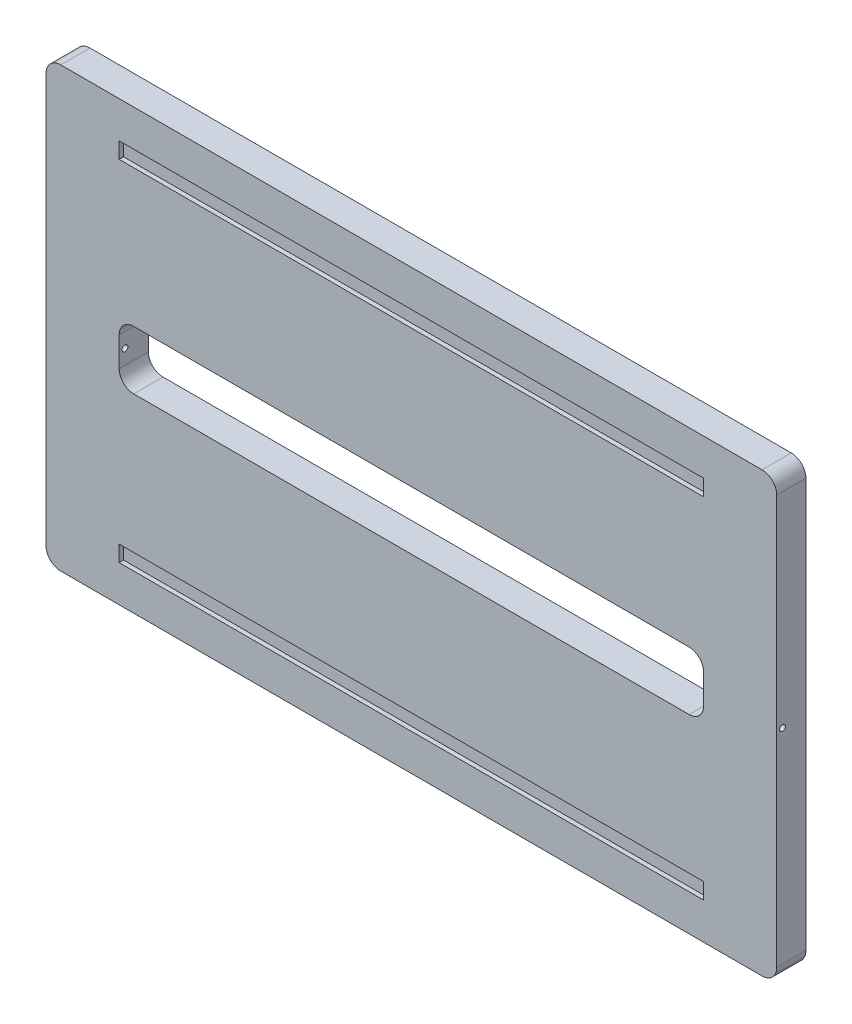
ISO-10303-21;
HEADER;
FILE_DESCRIPTION(('STEP AP214'),'2;1');
FILE_NAME('part.step','',(''),(''),'','','');
FILE_SCHEMA(('AUTOMOTIVE_DESIGN { 1 0 10303 214 1 1 1 1 }'));
ENDSEC;
DATA;
#1=APPLICATION_CONTEXT('core data for automotive mechanical design processes');
#2=APPLICATION_PROTOCOL_DEFINITION('international standard','automotive_design',2000,#1);
#3=PRODUCT_CONTEXT('',#1,'mechanical');
#4=PRODUCT('Part','Part','',(#3));
#5=PRODUCT_RELATED_PRODUCT_CATEGORY('part','',(#4));
#6=PRODUCT_DEFINITION_FORMATION('','',#4);
#7=PRODUCT_DEFINITION_CONTEXT('part definition',#1,'design');
#8=PRODUCT_DEFINITION('design','',#6,#7);
#9=PRODUCT_DEFINITION_SHAPE('','',#8);
#10=(LENGTH_UNIT() NAMED_UNIT(*) SI_UNIT(.MILLI.,.METRE.));
#11=(NAMED_UNIT(*) PLANE_ANGLE_UNIT() SI_UNIT($,.RADIAN.));
#12=(NAMED_UNIT(*) SI_UNIT($,.STERADIAN.) SOLID_ANGLE_UNIT());
#13=UNCERTAINTY_MEASURE_WITH_UNIT(LENGTH_MEASURE(1.E-05),#10,'distance_accuracy_value','');
#14=(GEOMETRIC_REPRESENTATION_CONTEXT(3) GLOBAL_UNCERTAINTY_ASSIGNED_CONTEXT((#13)) GLOBAL_UNIT_ASSIGNED_CONTEXT((#10,
#11,#12)) REPRESENTATION_CONTEXT('',''));
#15=CARTESIAN_POINT('',(0.,0.,0.));
#16=DIRECTION('',(0.,0.,1.));
#17=DIRECTION('',(1.,0.,0.));
#18=AXIS2_PLACEMENT_3D('',#15,#16,#17);
#19=CARTESIAN_POINT('',(50.,264.,17.));
#20=DIRECTION('',(0.,-1.,0.));
#21=DIRECTION('',(0.,0.,-1.));
#22=AXIS2_PLACEMENT_3D('',#19,#20,#21);
#23=PLANE('',#22);
#24=DIRECTION('',(0.,0.,-1.));
#25=VECTOR('',#24,1.);
#26=CARTESIAN_POINT('',(450.,264.,20.));
#27=LINE('',#26,#25);
#28=CARTESIAN_POINT('',(450.,264.,20.));
#29=VERTEX_POINT('',#28);
#30=CARTESIAN_POINT('',(450.,264.,17.));
#31=VERTEX_POINT('',#30);
#32=EDGE_CURVE('E217',#29,#31,#27,.T.);
#33=ORIENTED_EDGE('',*,*,#32,.T.);
#34=DIRECTION('',(1.,0.,0.));
#35=VECTOR('',#34,1.);
#36=CARTESIAN_POINT('',(50.,264.,17.));
#37=LINE('',#36,#35);
#38=CARTESIAN_POINT('',(50.,264.,17.));
#39=VERTEX_POINT('',#38);
#40=EDGE_CURVE('E202',#39,#31,#37,.T.);
#41=ORIENTED_EDGE('',*,*,#40,.F.);
#42=DIRECTION('',(0.,0.,-1.));
#43=VECTOR('',#42,1.);
#44=CARTESIAN_POINT('',(50.,264.,17.));
#45=LINE('',#44,#43);
#46=CARTESIAN_POINT('',(50.,264.,20.));
#47=VERTEX_POINT('',#46);
#48=EDGE_CURVE('E245',#47,#39,#45,.T.);
#49=ORIENTED_EDGE('',*,*,#48,.F.);
#50=DIRECTION('',(-1.,0.,0.));
#51=VECTOR('',#50,1.);
#52=CARTESIAN_POINT('',(0.,264.,20.));
#53=LINE('',#52,#51);
#54=EDGE_CURVE('E218',#29,#47,#53,.T.);
#55=ORIENTED_EDGE('',*,*,#54,.F.);
#56=EDGE_LOOP('',(#33,#41,#49,#55));
#57=FACE_BOUND('',#56,.T.);
#58=ADVANCED_FACE('F38',(#57),#23,.F.);
#59=CARTESIAN_POINT('',(50.,275.,17.));
#60=DIRECTION('',(0.,1.,0.));
#61=DIRECTION('',(0.,0.,1.));
#62=AXIS2_PLACEMENT_3D('',#59,#60,#61);
#63=PLANE('',#62);
#64=DIRECTION('',(0.,0.,-1.));
#65=VECTOR('',#64,1.);
#66=CARTESIAN_POINT('',(450.,275.,20.));
#67=LINE('',#66,#65);
#68=CARTESIAN_POINT('',(450.,275.,20.));
#69=VERTEX_POINT('',#68);
#70=CARTESIAN_POINT('',(450.,275.,17.));
#71=VERTEX_POINT('',#70);
#72=EDGE_CURVE('E223',#69,#71,#67,.T.);
#73=ORIENTED_EDGE('',*,*,#72,.F.);
#74=DIRECTION('',(1.,0.,0.));
#75=VECTOR('',#74,1.);
#76=CARTESIAN_POINT('',(0.,275.,20.));
#77=LINE('',#76,#75);
#78=CARTESIAN_POINT('',(50.,275.,20.));
#79=VERTEX_POINT('',#78);
#80=EDGE_CURVE('E329',#79,#69,#77,.T.);
#81=ORIENTED_EDGE('',*,*,#80,.F.);
#82=DIRECTION('',(0.,0.,1.));
#83=VECTOR('',#82,1.);
#84=CARTESIAN_POINT('',(50.,275.,17.));
#85=LINE('',#84,#83);
#86=CARTESIAN_POINT('',(50.,275.,17.));
#87=VERTEX_POINT('',#86);
#88=EDGE_CURVE('E242',#87,#79,#85,.T.);
#89=ORIENTED_EDGE('',*,*,#88,.F.);
#90=DIRECTION('',(1.,0.,0.));
#91=VECTOR('',#90,1.);
#92=CARTESIAN_POINT('',(50.,275.,17.));
#93=LINE('',#92,#91);
#94=EDGE_CURVE('E214',#87,#71,#93,.T.);
#95=ORIENTED_EDGE('',*,*,#94,.T.);
#96=EDGE_LOOP('',(#73,#81,#89,#95));
#97=FACE_BOUND('',#96,.T.);
#98=ADVANCED_FACE('F494',(#97),#63,.F.);
#99=CARTESIAN_POINT('',(50.,275.,17.));
#100=DIRECTION('',(0.,0.,-1.));
#101=DIRECTION('',(-1.,0.,0.));
#102=AXIS2_PLACEMENT_3D('',#99,#100,#101);
#103=PLANE('',#102);
#104=DIRECTION('',(0.,-1.,0.));
#105=VECTOR('',#104,1.);
#106=CARTESIAN_POINT('',(450.,264.,17.));
#107=LINE('',#106,#105);
#108=EDGE_CURVE('E206',#71,#31,#107,.T.);
#109=ORIENTED_EDGE('',*,*,#108,.F.);
#110=ORIENTED_EDGE('',*,*,#94,.F.);
#111=DIRECTION('',(0.,1.,0.));
#112=VECTOR('',#111,1.);
#113=CARTESIAN_POINT('',(50.,275.,17.));
#114=LINE('',#113,#112);
#115=EDGE_CURVE('E209',#39,#87,#114,.T.);
#116=ORIENTED_EDGE('',*,*,#115,.F.);
#117=ORIENTED_EDGE('',*,*,#40,.T.);
#118=EDGE_LOOP('',(#109,#110,#116,#117));
#119=FACE_BOUND('',#118,.T.);
#120=ADVANCED_FACE('F204',(#119),#103,.F.);
#121=CARTESIAN_POINT('',(50.,25.,17.));
#122=DIRECTION('',(0.,-1.,0.));
#123=DIRECTION('',(0.,0.,-1.));
#124=AXIS2_PLACEMENT_3D('',#121,#122,#123);
#125=PLANE('',#124);
#126=DIRECTION('',(0.,0.,-1.));
#127=VECTOR('',#126,1.);
#128=CARTESIAN_POINT('',(450.,25.,20.));
#129=LINE('',#128,#127);
#130=CARTESIAN_POINT('',(450.,25.,20.));
#131=VERTEX_POINT('',#130);
#132=CARTESIAN_POINT('',(450.,25.,17.));
#133=VERTEX_POINT('',#132);
#134=EDGE_CURVE('E254',#131,#133,#129,.T.);
#135=ORIENTED_EDGE('',*,*,#134,.T.);
#136=DIRECTION('',(1.,0.,0.));
#137=VECTOR('',#136,1.);
#138=CARTESIAN_POINT('',(50.,25.,17.));
#139=LINE('',#138,#137);
#140=CARTESIAN_POINT('',(50.,25.,17.));
#141=VERTEX_POINT('',#140);
#142=EDGE_CURVE('E276',#141,#133,#139,.T.);
#143=ORIENTED_EDGE('',*,*,#142,.F.);
#144=DIRECTION('',(0.,0.,-1.));
#145=VECTOR('',#144,1.);
#146=CARTESIAN_POINT('',(50.,25.,17.));
#147=LINE('',#146,#145);
#148=CARTESIAN_POINT('',(50.,25.,20.));
#149=VERTEX_POINT('',#148);
#150=EDGE_CURVE('E272',#149,#141,#147,.T.);
#151=ORIENTED_EDGE('',*,*,#150,.F.);
#152=DIRECTION('',(-1.,0.,0.));
#153=VECTOR('',#152,1.);
#154=CARTESIAN_POINT('',(0.,25.,20.));
#155=LINE('',#154,#153);
#156=EDGE_CURVE('E322',#131,#149,#155,.T.);
#157=ORIENTED_EDGE('',*,*,#156,.F.);
#158=EDGE_LOOP('',(#135,#143,#151,#157));
#159=FACE_BOUND('',#158,.T.);
#160=ADVANCED_FACE('F507',(#159),#125,.F.);
#161=CARTESIAN_POINT('',(50.,36.,17.));
#162=DIRECTION('',(0.,1.,0.));
#163=DIRECTION('',(0.,0.,1.));
#164=AXIS2_PLACEMENT_3D('',#161,#162,#163);
#165=PLANE('',#164);
#166=DIRECTION('',(0.,0.,-1.));
#167=VECTOR('',#166,1.);
#168=CARTESIAN_POINT('',(450.,36.,20.));
#169=LINE('',#168,#167);
#170=CARTESIAN_POINT('',(450.,36.,20.));
#171=VERTEX_POINT('',#170);
#172=CARTESIAN_POINT('',(450.,36.,17.));
#173=VERTEX_POINT('',#172);
#174=EDGE_CURVE('E261',#171,#173,#169,.T.);
#175=ORIENTED_EDGE('',*,*,#174,.F.);
#176=DIRECTION('',(1.,0.,0.));
#177=VECTOR('',#176,1.);
#178=CARTESIAN_POINT('',(0.,36.,20.));
#179=LINE('',#178,#177);
#180=CARTESIAN_POINT('',(50.,36.,20.));
#181=VERTEX_POINT('',#180);
#182=EDGE_CURVE('E318',#181,#171,#179,.T.);
#183=ORIENTED_EDGE('',*,*,#182,.F.);
#184=DIRECTION('',(0.,0.,1.));
#185=VECTOR('',#184,1.);
#186=CARTESIAN_POINT('',(50.,36.,17.));
#187=LINE('',#186,#185);
#188=CARTESIAN_POINT('',(50.,36.,17.));
#189=VERTEX_POINT('',#188);
#190=EDGE_CURVE('E269',#189,#181,#187,.T.);
#191=ORIENTED_EDGE('',*,*,#190,.F.);
#192=DIRECTION('',(1.,0.,0.));
#193=VECTOR('',#192,1.);
#194=CARTESIAN_POINT('',(50.,36.,17.));
#195=LINE('',#194,#193);
#196=EDGE_CURVE('E275',#189,#173,#195,.T.);
#197=ORIENTED_EDGE('',*,*,#196,.T.);
#198=EDGE_LOOP('',(#175,#183,#191,#197));
#199=FACE_BOUND('',#198,.T.);
#200=ADVANCED_FACE('F518',(#199),#165,.F.);
#201=CARTESIAN_POINT('',(50.,25.,17.));
#202=DIRECTION('',(0.,0.,-1.));
#203=DIRECTION('',(-1.,0.,0.));
#204=AXIS2_PLACEMENT_3D('',#201,#202,#203);
#205=PLANE('',#204);
#206=DIRECTION('',(0.,-1.,0.));
#207=VECTOR('',#206,1.);
#208=CARTESIAN_POINT('',(450.,36.,17.));
#209=LINE('',#208,#207);
#210=EDGE_CURVE('E213',#173,#133,#209,.T.);
#211=ORIENTED_EDGE('',*,*,#210,.F.);
#212=ORIENTED_EDGE('',*,*,#196,.F.);
#213=DIRECTION('',(0.,1.,0.));
#214=VECTOR('',#213,1.);
#215=CARTESIAN_POINT('',(50.,25.,17.));
#216=LINE('',#215,#214);
#217=EDGE_CURVE('E265',#141,#189,#216,.T.);
#218=ORIENTED_EDGE('',*,*,#217,.F.);
#219=ORIENTED_EDGE('',*,*,#142,.T.);
#220=EDGE_LOOP('',(#211,#212,#218,#219));
#221=FACE_BOUND('',#220,.T.);
#222=ADVANCED_FACE('F522',(#221),#205,.F.);
#223=CARTESIAN_POINT('',(0.,0.,20.));
#224=DIRECTION('',(1.,0.,0.));
#225=DIRECTION('',(0.,0.,-1.));
#226=AXIS2_PLACEMENT_3D('',#223,#224,#225);
#227=PLANE('',#226);
#228=CARTESIAN_POINT('',(0.,150.,16.));
#229=DIRECTION('',(1.,0.,0.));
#230=DIRECTION('',(0.,0.,-1.));
#231=AXIS2_PLACEMENT_3D('',#228,#229,#230);
#232=CIRCLE('',#231,2.);
#233=CARTESIAN_POINT('',(0.,150.,14.));
#234=VERTEX_POINT('',#233);
#235=EDGE_CURVE('E810',#234,#234,#232,.T.);
#236=ORIENTED_EDGE('',*,*,#235,.T.);
#237=EDGE_LOOP('',(#236));
#238=FACE_BOUND('',#237,.T.);
#239=DIRECTION('',(0.,-1.,0.));
#240=VECTOR('',#239,1.);
#241=CARTESIAN_POINT('',(0.,0.,20.));
#242=LINE('',#241,#240);
#243=CARTESIAN_POINT('',(0.,290.,20.));
#244=VERTEX_POINT('',#243);
#245=CARTESIAN_POINT('',(0.,10.,20.));
#246=VERTEX_POINT('',#245);
#247=EDGE_CURVE('E283',#244,#246,#242,.T.);
#248=ORIENTED_EDGE('',*,*,#247,.F.);
#249=DIRECTION('',(0.,0.,-1.));
#250=VECTOR('',#249,1.);
#251=CARTESIAN_POINT('',(0.,290.,20.));
#252=LINE('',#251,#250);
#253=CARTESIAN_POINT('',(0.,290.,0.));
#254=VERTEX_POINT('',#253);
#255=EDGE_CURVE('E338',#244,#254,#252,.T.);
#256=ORIENTED_EDGE('',*,*,#255,.T.);
#257=DIRECTION('',(0.,-1.,0.));
#258=VECTOR('',#257,1.);
#259=CARTESIAN_POINT('',(0.,0.,0.));
#260=LINE('',#259,#258);
#261=CARTESIAN_POINT('',(0.,10.,0.));
#262=VERTEX_POINT('',#261);
#263=EDGE_CURVE('E279',#254,#262,#260,.T.);
#264=ORIENTED_EDGE('',*,*,#263,.T.);
#265=DIRECTION('',(0.,0.,-1.));
#266=VECTOR('',#265,1.);
#267=CARTESIAN_POINT('',(0.,10.,20.));
#268=LINE('',#267,#266);
#269=EDGE_CURVE('E335',#262,#246,#268,.F.);
#270=ORIENTED_EDGE('',*,*,#269,.T.);
#271=EDGE_LOOP('',(#248,#256,#264,#270));
#272=FACE_BOUND('',#271,.T.);
#273=ADVANCED_FACE('F526',(#238,#272),#227,.F.);
#274=CARTESIAN_POINT('',(0.,0.,20.));
#275=DIRECTION('',(0.,1.,0.));
#276=DIRECTION('',(0.,0.,1.));
#277=AXIS2_PLACEMENT_3D('',#274,#275,#276);
#278=PLANE('',#277);
#279=DIRECTION('',(1.,0.,0.));
#280=VECTOR('',#279,1.);
#281=CARTESIAN_POINT('',(0.,0.,20.));
#282=LINE('',#281,#280);
#283=CARTESIAN_POINT('',(10.,0.,20.));
#284=VERTEX_POINT('',#283);
#285=CARTESIAN_POINT('',(490.,0.,20.));
#286=VERTEX_POINT('',#285);
#287=EDGE_CURVE('E287',#284,#286,#282,.T.);
#288=ORIENTED_EDGE('',*,*,#287,.F.);
#289=DIRECTION('',(0.,0.,-1.));
#290=VECTOR('',#289,1.);
#291=CARTESIAN_POINT('',(10.,0.,20.));
#292=LINE('',#291,#290);
#293=CARTESIAN_POINT('',(10.,0.,0.));
#294=VERTEX_POINT('',#293);
#295=EDGE_CURVE('E383',#284,#294,#292,.T.);
#296=ORIENTED_EDGE('',*,*,#295,.T.);
#297=DIRECTION('',(1.,0.,0.));
#298=VECTOR('',#297,1.);
#299=CARTESIAN_POINT('',(0.,0.,0.));
#300=LINE('',#299,#298);
#301=CARTESIAN_POINT('',(490.,0.,0.));
#302=VERTEX_POINT('',#301);
#303=EDGE_CURVE('E304',#294,#302,#300,.T.);
#304=ORIENTED_EDGE('',*,*,#303,.T.);
#305=DIRECTION('',(0.,0.,-1.));
#306=VECTOR('',#305,1.);
#307=CARTESIAN_POINT('',(490.,0.,20.));
#308=LINE('',#307,#306);
#309=EDGE_CURVE('E380',#302,#286,#308,.F.);
#310=ORIENTED_EDGE('',*,*,#309,.T.);
#311=EDGE_LOOP('',(#288,#296,#304,#310));
#312=FACE_BOUND('',#311,.T.);
#313=ADVANCED_FACE('F539',(#312),#278,.F.);
#314=CARTESIAN_POINT('',(500.,0.,20.));
#315=DIRECTION('',(-1.,0.,0.));
#316=DIRECTION('',(0.,0.,1.));
#317=AXIS2_PLACEMENT_3D('',#314,#315,#316);
#318=PLANE('',#317);
#319=CARTESIAN_POINT('',(500.,150.,16.));
#320=DIRECTION('',(1.,0.,0.));
#321=DIRECTION('',(0.,0.,-1.));
#322=AXIS2_PLACEMENT_3D('',#319,#320,#321);
#323=CIRCLE('',#322,2.);
#324=CARTESIAN_POINT('',(500.,150.,14.));
#325=VERTEX_POINT('',#324);
#326=EDGE_CURVE('E816',#325,#325,#323,.T.);
#327=ORIENTED_EDGE('',*,*,#326,.F.);
#328=EDGE_LOOP('',(#327));
#329=FACE_BOUND('',#328,.T.);
#330=DIRECTION('',(0.,1.,0.));
#331=VECTOR('',#330,1.);
#332=CARTESIAN_POINT('',(500.,0.,0.));
#333=LINE('',#332,#331);
#334=CARTESIAN_POINT('',(500.,10.,0.));
#335=VERTEX_POINT('',#334);
#336=CARTESIAN_POINT('',(500.,290.,0.));
#337=VERTEX_POINT('',#336);
#338=EDGE_CURVE('E308',#335,#337,#333,.T.);
#339=ORIENTED_EDGE('',*,*,#338,.T.);
#340=DIRECTION('',(0.,0.,-1.));
#341=VECTOR('',#340,1.);
#342=CARTESIAN_POINT('',(500.,290.,20.));
#343=LINE('',#342,#341);
#344=CARTESIAN_POINT('',(500.,290.,20.));
#345=VERTEX_POINT('',#344);
#346=EDGE_CURVE('E377',#337,#345,#343,.F.);
#347=ORIENTED_EDGE('',*,*,#346,.T.);
#348=DIRECTION('',(0.,1.,0.));
#349=VECTOR('',#348,1.);
#350=CARTESIAN_POINT('',(500.,0.,20.));
#351=LINE('',#350,#349);
#352=CARTESIAN_POINT('',(500.,10.,20.));
#353=VERTEX_POINT('',#352);
#354=EDGE_CURVE('E292',#353,#345,#351,.T.);
#355=ORIENTED_EDGE('',*,*,#354,.F.);
#356=DIRECTION('',(0.,0.,-1.));
#357=VECTOR('',#356,1.);
#358=CARTESIAN_POINT('',(500.,10.,20.));
#359=LINE('',#358,#357);
#360=EDGE_CURVE('E373',#353,#335,#359,.T.);
#361=ORIENTED_EDGE('',*,*,#360,.T.);
#362=EDGE_LOOP('',(#339,#347,#355,#361));
#363=FACE_BOUND('',#362,.T.);
#364=ADVANCED_FACE('F535',(#329,#363),#318,.F.);
#365=CARTESIAN_POINT('',(0.,300.,20.));
#366=DIRECTION('',(0.,-1.,0.));
#367=DIRECTION('',(0.,0.,-1.));
#368=AXIS2_PLACEMENT_3D('',#365,#366,#367);
#369=PLANE('',#368);
#370=DIRECTION('',(-1.,0.,0.));
#371=VECTOR('',#370,1.);
#372=CARTESIAN_POINT('',(0.,300.,0.));
#373=LINE('',#372,#371);
#374=CARTESIAN_POINT('',(490.,300.,0.));
#375=VERTEX_POINT('',#374);
#376=CARTESIAN_POINT('',(10.,300.,0.));
#377=VERTEX_POINT('',#376);
#378=EDGE_CURVE('E288',#375,#377,#373,.T.);
#379=ORIENTED_EDGE('',*,*,#378,.T.);
#380=DIRECTION('',(0.,0.,-1.));
#381=VECTOR('',#380,1.);
#382=CARTESIAN_POINT('',(10.,300.,20.));
#383=LINE('',#382,#381);
#384=CARTESIAN_POINT('',(10.,300.,20.));
#385=VERTEX_POINT('',#384);
#386=EDGE_CURVE('E358',#377,#385,#383,.F.);
#387=ORIENTED_EDGE('',*,*,#386,.T.);
#388=DIRECTION('',(-1.,0.,0.));
#389=VECTOR('',#388,1.);
#390=CARTESIAN_POINT('',(0.,300.,20.));
#391=LINE('',#390,#389);
#392=CARTESIAN_POINT('',(490.,300.,20.));
#393=VERTEX_POINT('',#392);
#394=EDGE_CURVE('E296',#393,#385,#391,.T.);
#395=ORIENTED_EDGE('',*,*,#394,.F.);
#396=DIRECTION('',(0.,0.,-1.));
#397=VECTOR('',#396,1.);
#398=CARTESIAN_POINT('',(490.,300.,20.));
#399=LINE('',#398,#397);
#400=EDGE_CURVE('E354',#393,#375,#399,.T.);
#401=ORIENTED_EDGE('',*,*,#400,.T.);
#402=EDGE_LOOP('',(#379,#387,#395,#401));
#403=FACE_BOUND('',#402,.T.);
#404=ADVANCED_FACE('F530',(#403),#369,.F.);
#405=CARTESIAN_POINT('',(0.,0.,20.));
#406=DIRECTION('',(0.,0.,-1.));
#407=DIRECTION('',(-1.,0.,0.));
#408=AXIS2_PLACEMENT_3D('',#405,#406,#407);
#409=PLANE('',#408);
#410=DIRECTION('',(1.,0.,0.));
#411=VECTOR('',#410,1.);
#412=CARTESIAN_POINT('',(50.,130.,20.));
#413=LINE('',#412,#411);
#414=CARTESIAN_POINT('',(60.,130.,20.));
#415=VERTEX_POINT('',#414);
#416=CARTESIAN_POINT('',(440.,130.,20.));
#417=VERTEX_POINT('',#416);
#418=EDGE_CURVE('E439',#415,#417,#413,.T.);
#419=ORIENTED_EDGE('',*,*,#418,.F.);
#420=CARTESIAN_POINT('',(60.,140.,20.));
#421=DIRECTION('',(0.,0.,-1.));
#422=DIRECTION('',(-1.,0.,0.));
#423=AXIS2_PLACEMENT_3D('',#420,#421,#422);
#424=CIRCLE('',#423,10.);
#425=CARTESIAN_POINT('',(50.,140.,20.));
#426=VERTEX_POINT('',#425);
#427=EDGE_CURVE('E48',#415,#426,#424,.T.);
#428=ORIENTED_EDGE('',*,*,#427,.T.);
#429=DIRECTION('',(0.,-1.,0.));
#430=VECTOR('',#429,1.);
#431=CARTESIAN_POINT('',(50.,130.,20.));
#432=LINE('',#431,#430);
#433=CARTESIAN_POINT('',(50.,160.,20.));
#434=VERTEX_POINT('',#433);
#435=EDGE_CURVE('E437',#434,#426,#432,.T.);
#436=ORIENTED_EDGE('',*,*,#435,.F.);
#437=CARTESIAN_POINT('',(60.,160.,20.));
#438=DIRECTION('',(0.,0.,-1.));
#439=DIRECTION('',(-1.,0.,0.));
#440=AXIS2_PLACEMENT_3D('',#437,#438,#439);
#441=CIRCLE('',#440,10.);
#442=CARTESIAN_POINT('',(60.,170.,20.));
#443=VERTEX_POINT('',#442);
#444=EDGE_CURVE('E426',#434,#443,#441,.T.);
#445=ORIENTED_EDGE('',*,*,#444,.T.);
#446=DIRECTION('',(-1.,0.,0.));
#447=VECTOR('',#446,1.);
#448=CARTESIAN_POINT('',(50.,170.,20.));
#449=LINE('',#448,#447);
#450=CARTESIAN_POINT('',(440.,170.,20.));
#451=VERTEX_POINT('',#450);
#452=EDGE_CURVE('E464',#451,#443,#449,.T.);
#453=ORIENTED_EDGE('',*,*,#452,.F.);
#454=CARTESIAN_POINT('',(440.,160.,20.));
#455=DIRECTION('',(0.,0.,-1.));
#456=DIRECTION('',(-1.,0.,0.));
#457=AXIS2_PLACEMENT_3D('',#454,#455,#456);
#458=CIRCLE('',#457,10.);
#459=CARTESIAN_POINT('',(450.,160.,20.));
#460=VERTEX_POINT('',#459);
#461=EDGE_CURVE('E414',#451,#460,#458,.T.);
#462=ORIENTED_EDGE('',*,*,#461,.T.);
#463=DIRECTION('',(0.,1.,0.));
#464=VECTOR('',#463,1.);
#465=CARTESIAN_POINT('',(450.,130.,20.));
#466=LINE('',#465,#464);
#467=CARTESIAN_POINT('',(450.,140.,20.));
#468=VERTEX_POINT('',#467);
#469=EDGE_CURVE('E470',#468,#460,#466,.T.);
#470=ORIENTED_EDGE('',*,*,#469,.F.);
#471=CARTESIAN_POINT('',(440.,140.,20.));
#472=DIRECTION('',(0.,0.,-1.));
#473=DIRECTION('',(-1.,0.,0.));
#474=AXIS2_PLACEMENT_3D('',#471,#472,#473);
#475=CIRCLE('',#474,10.);
#476=EDGE_CURVE('E420',#468,#417,#475,.T.);
#477=ORIENTED_EDGE('',*,*,#476,.T.);
#478=EDGE_LOOP('',(#419,#428,#436,#445,#453,#462,#470,#477));
#479=FACE_BOUND('',#478,.T.);
#480=DIRECTION('',(0.,-1.,0.));
#481=VECTOR('',#480,1.);
#482=CARTESIAN_POINT('',(450.,264.,20.));
#483=LINE('',#482,#481);
#484=EDGE_CURVE('E224',#69,#29,#483,.T.);
#485=ORIENTED_EDGE('',*,*,#484,.T.);
#486=ORIENTED_EDGE('',*,*,#54,.T.);
#487=DIRECTION('',(0.,1.,0.));
#488=VECTOR('',#487,1.);
#489=CARTESIAN_POINT('',(50.,0.,20.));
#490=LINE('',#489,#488);
#491=EDGE_CURVE('E325',#47,#79,#490,.T.);
#492=ORIENTED_EDGE('',*,*,#491,.T.);
#493=ORIENTED_EDGE('',*,*,#80,.T.);
#494=EDGE_LOOP('',(#485,#486,#492,#493));
#495=FACE_BOUND('',#494,.T.);
#496=ORIENTED_EDGE('',*,*,#394,.T.);
#497=CARTESIAN_POINT('',(10.,290.,20.));
#498=DIRECTION('',(0.,0.,-1.));
#499=DIRECTION('',(-1.,0.,0.));
#500=AXIS2_PLACEMENT_3D('',#497,#498,#499);
#501=CIRCLE('',#500,10.);
#502=EDGE_CURVE('E370',#385,#244,#501,.F.);
#503=ORIENTED_EDGE('',*,*,#502,.T.);
#504=ORIENTED_EDGE('',*,*,#247,.T.);
#505=CARTESIAN_POINT('',(10.,10.,20.));
#506=DIRECTION('',(0.,0.,-1.));
#507=DIRECTION('',(-1.,0.,0.));
#508=AXIS2_PLACEMENT_3D('',#505,#506,#507);
#509=CIRCLE('',#508,10.);
#510=EDGE_CURVE('E364',#246,#284,#509,.F.);
#511=ORIENTED_EDGE('',*,*,#510,.T.);
#512=ORIENTED_EDGE('',*,*,#287,.T.);
#513=CARTESIAN_POINT('',(490.,10.,20.));
#514=DIRECTION('',(0.,0.,-1.));
#515=DIRECTION('',(-1.,0.,0.));
#516=AXIS2_PLACEMENT_3D('',#513,#514,#515);
#517=CIRCLE('',#516,10.);
#518=EDGE_CURVE('E361',#286,#353,#517,.F.);
#519=ORIENTED_EDGE('',*,*,#518,.T.);
#520=ORIENTED_EDGE('',*,*,#354,.T.);
#521=CARTESIAN_POINT('',(490.,290.,20.));
#522=DIRECTION('',(0.,0.,-1.));
#523=DIRECTION('',(-1.,0.,0.));
#524=AXIS2_PLACEMENT_3D('',#521,#522,#523);
#525=CIRCLE('',#524,10.);
#526=EDGE_CURVE('E367',#345,#393,#525,.F.);
#527=ORIENTED_EDGE('',*,*,#526,.T.);
#528=EDGE_LOOP('',(#496,#503,#504,#511,#512,#519,#520,#527));
#529=FACE_BOUND('',#528,.T.);
#530=DIRECTION('',(0.,-1.,0.));
#531=VECTOR('',#530,1.);
#532=CARTESIAN_POINT('',(450.,36.,20.));
#533=LINE('',#532,#531);
#534=EDGE_CURVE('E250',#171,#131,#533,.T.);
#535=ORIENTED_EDGE('',*,*,#534,.T.);
#536=ORIENTED_EDGE('',*,*,#156,.T.);
#537=DIRECTION('',(0.,-1.,0.));
#538=VECTOR('',#537,1.);
#539=CARTESIAN_POINT('',(50.,0.,20.));
#540=LINE('',#539,#538);
#541=EDGE_CURVE('E300',#181,#149,#540,.T.);
#542=ORIENTED_EDGE('',*,*,#541,.F.);
#543=ORIENTED_EDGE('',*,*,#182,.T.);
#544=EDGE_LOOP('',(#535,#536,#542,#543));
#545=FACE_BOUND('',#544,.T.);
#546=ADVANCED_FACE('F435',(#479,#495,#529,#545),#409,.F.);
#547=CARTESIAN_POINT('',(0.,0.,0.));
#548=DIRECTION('',(0.,0.,-1.));
#549=DIRECTION('',(-1.,0.,0.));
#550=AXIS2_PLACEMENT_3D('',#547,#548,#549);
#551=PLANE('',#550);
#552=DIRECTION('',(-1.,0.,0.));
#553=VECTOR('',#552,1.);
#554=CARTESIAN_POINT('',(50.,170.,0.));
#555=LINE('',#554,#553);
#556=CARTESIAN_POINT('',(440.,170.,0.));
#557=VERTEX_POINT('',#556);
#558=CARTESIAN_POINT('',(60.,170.,0.));
#559=VERTEX_POINT('',#558);
#560=EDGE_CURVE('E229',#557,#559,#555,.T.);
#561=ORIENTED_EDGE('',*,*,#560,.T.);
#562=CARTESIAN_POINT('',(60.,160.,0.));
#563=DIRECTION('',(0.,0.,-1.));
#564=DIRECTION('',(-1.,0.,0.));
#565=AXIS2_PLACEMENT_3D('',#562,#563,#564);
#566=CIRCLE('',#565,10.);
#567=CARTESIAN_POINT('',(50.,160.,0.));
#568=VERTEX_POINT('',#567);
#569=EDGE_CURVE('E62',#559,#568,#566,.F.);
#570=ORIENTED_EDGE('',*,*,#569,.T.);
#571=DIRECTION('',(0.,-1.,0.));
#572=VECTOR('',#571,1.);
#573=CARTESIAN_POINT('',(50.,130.,0.));
#574=LINE('',#573,#572);
#575=CARTESIAN_POINT('',(50.,140.,0.));
#576=VERTEX_POINT('',#575);
#577=EDGE_CURVE('E454',#568,#576,#574,.T.);
#578=ORIENTED_EDGE('',*,*,#577,.T.);
#579=CARTESIAN_POINT('',(60.,140.,0.));
#580=DIRECTION('',(0.,0.,-1.));
#581=DIRECTION('',(-1.,0.,0.));
#582=AXIS2_PLACEMENT_3D('',#579,#580,#581);
#583=CIRCLE('',#582,10.);
#584=CARTESIAN_POINT('',(60.,130.,0.));
#585=VERTEX_POINT('',#584);
#586=EDGE_CURVE('E11',#576,#585,#583,.F.);
#587=ORIENTED_EDGE('',*,*,#586,.T.);
#588=DIRECTION('',(1.,0.,0.));
#589=VECTOR('',#588,1.);
#590=CARTESIAN_POINT('',(50.,130.,0.));
#591=LINE('',#590,#589);
#592=CARTESIAN_POINT('',(440.,130.,0.));
#593=VERTEX_POINT('',#592);
#594=EDGE_CURVE('E452',#585,#593,#591,.T.);
#595=ORIENTED_EDGE('',*,*,#594,.T.);
#596=CARTESIAN_POINT('',(440.,140.,0.));
#597=DIRECTION('',(0.,0.,-1.));
#598=DIRECTION('',(-1.,0.,0.));
#599=AXIS2_PLACEMENT_3D('',#596,#597,#598);
#600=CIRCLE('',#599,10.);
#601=CARTESIAN_POINT('',(450.,140.,0.));
#602=VERTEX_POINT('',#601);
#603=EDGE_CURVE('E423',#593,#602,#600,.F.);
#604=ORIENTED_EDGE('',*,*,#603,.T.);
#605=DIRECTION('',(0.,1.,0.));
#606=VECTOR('',#605,1.);
#607=CARTESIAN_POINT('',(450.,130.,0.));
#608=LINE('',#607,#606);
#609=CARTESIAN_POINT('',(450.,160.,0.));
#610=VERTEX_POINT('',#609);
#611=EDGE_CURVE('E234',#602,#610,#608,.T.);
#612=ORIENTED_EDGE('',*,*,#611,.T.);
#613=CARTESIAN_POINT('',(440.,160.,0.));
#614=DIRECTION('',(0.,0.,-1.));
#615=DIRECTION('',(-1.,0.,0.));
#616=AXIS2_PLACEMENT_3D('',#613,#614,#615);
#617=CIRCLE('',#616,10.);
#618=EDGE_CURVE('E417',#610,#557,#617,.F.);
#619=ORIENTED_EDGE('',*,*,#618,.T.);
#620=EDGE_LOOP('',(#561,#570,#578,#587,#595,#604,#612,#619));
#621=FACE_BOUND('',#620,.T.);
#622=ORIENTED_EDGE('',*,*,#263,.F.);
#623=CARTESIAN_POINT('',(10.,290.,0.));
#624=DIRECTION('',(0.,0.,-1.));
#625=DIRECTION('',(-1.,0.,0.));
#626=AXIS2_PLACEMENT_3D('',#623,#624,#625);
#627=CIRCLE('',#626,10.);
#628=EDGE_CURVE('E351',#254,#377,#627,.T.);
#629=ORIENTED_EDGE('',*,*,#628,.T.);
#630=ORIENTED_EDGE('',*,*,#378,.F.);
#631=CARTESIAN_POINT('',(490.,290.,0.));
#632=DIRECTION('',(0.,0.,-1.));
#633=DIRECTION('',(-1.,0.,0.));
#634=AXIS2_PLACEMENT_3D('',#631,#632,#633);
#635=CIRCLE('',#634,10.);
#636=EDGE_CURVE('E348',#375,#337,#635,.T.);
#637=ORIENTED_EDGE('',*,*,#636,.T.);
#638=ORIENTED_EDGE('',*,*,#338,.F.);
#639=CARTESIAN_POINT('',(490.,10.,0.));
#640=DIRECTION('',(0.,0.,-1.));
#641=DIRECTION('',(-1.,0.,0.));
#642=AXIS2_PLACEMENT_3D('',#639,#640,#641);
#643=CIRCLE('',#642,10.);
#644=EDGE_CURVE('E342',#335,#302,#643,.T.);
#645=ORIENTED_EDGE('',*,*,#644,.T.);
#646=ORIENTED_EDGE('',*,*,#303,.F.);
#647=CARTESIAN_POINT('',(10.,10.,0.));
#648=DIRECTION('',(0.,0.,-1.));
#649=DIRECTION('',(-1.,0.,0.));
#650=AXIS2_PLACEMENT_3D('',#647,#648,#649);
#651=CIRCLE('',#650,10.);
#652=EDGE_CURVE('E345',#294,#262,#651,.T.);
#653=ORIENTED_EDGE('',*,*,#652,.T.);
#654=EDGE_LOOP('',(#622,#629,#630,#637,#638,#645,#646,#653));
#655=FACE_BOUND('',#654,.T.);
#656=ADVANCED_FACE('F450',(#621,#655),#551,.T.);
#657=CARTESIAN_POINT('',(50.,0.,0.));
#658=DIRECTION('',(1.,0.,0.));
#659=DIRECTION('',(0.,0.,-1.));
#660=AXIS2_PLACEMENT_3D('',#657,#658,#659);
#661=PLANE('',#660);
#662=ORIENTED_EDGE('',*,*,#541,.T.);
#663=ORIENTED_EDGE('',*,*,#150,.T.);
#664=ORIENTED_EDGE('',*,*,#217,.T.);
#665=ORIENTED_EDGE('',*,*,#190,.T.);
#666=EDGE_LOOP('',(#662,#663,#664,#665));
#667=FACE_BOUND('',#666,.T.);
#668=ADVANCED_FACE('F511',(#667),#661,.T.);
#669=CARTESIAN_POINT('',(450.,36.,20.));
#670=DIRECTION('',(1.,0.,0.));
#671=DIRECTION('',(0.,0.,-1.));
#672=AXIS2_PLACEMENT_3D('',#669,#670,#671);
#673=PLANE('',#672);
#674=ORIENTED_EDGE('',*,*,#210,.T.);
#675=ORIENTED_EDGE('',*,*,#134,.F.);
#676=ORIENTED_EDGE('',*,*,#534,.F.);
#677=ORIENTED_EDGE('',*,*,#174,.T.);
#678=EDGE_LOOP('',(#674,#675,#676,#677));
#679=FACE_BOUND('',#678,.T.);
#680=ADVANCED_FACE('F508',(#679),#673,.F.);
#681=CARTESIAN_POINT('',(50.,0.,0.));
#682=DIRECTION('',(-1.,0.,0.));
#683=DIRECTION('',(0.,0.,1.));
#684=AXIS2_PLACEMENT_3D('',#681,#682,#683);
#685=PLANE('',#684);
#686=ORIENTED_EDGE('',*,*,#48,.T.);
#687=ORIENTED_EDGE('',*,*,#115,.T.);
#688=ORIENTED_EDGE('',*,*,#88,.T.);
#689=ORIENTED_EDGE('',*,*,#491,.F.);
#690=EDGE_LOOP('',(#686,#687,#688,#689));
#691=FACE_BOUND('',#690,.T.);
#692=ADVANCED_FACE('F502',(#691),#685,.F.);
#693=CARTESIAN_POINT('',(450.,264.,20.));
#694=DIRECTION('',(1.,0.,0.));
#695=DIRECTION('',(0.,1.,0.));
#696=AXIS2_PLACEMENT_3D('',#693,#694,#695);
#697=PLANE('',#696);
#698=ORIENTED_EDGE('',*,*,#108,.T.);
#699=ORIENTED_EDGE('',*,*,#32,.F.);
#700=ORIENTED_EDGE('',*,*,#484,.F.);
#701=ORIENTED_EDGE('',*,*,#72,.T.);
#702=EDGE_LOOP('',(#698,#699,#700,#701));
#703=FACE_BOUND('',#702,.T.);
#704=ADVANCED_FACE('F227',(#703),#697,.F.);
#705=CARTESIAN_POINT('',(10.,290.,20.));
#706=DIRECTION('',(0.,0.,-1.));
#707=DIRECTION('',(-1.,0.,0.));
#708=AXIS2_PLACEMENT_3D('',#705,#706,#707);
#709=CYLINDRICAL_SURFACE('',#708,10.);
#710=ORIENTED_EDGE('',*,*,#502,.F.);
#711=ORIENTED_EDGE('',*,*,#386,.F.);
#712=ORIENTED_EDGE('',*,*,#628,.F.);
#713=ORIENTED_EDGE('',*,*,#255,.F.);
#714=EDGE_LOOP('',(#710,#711,#712,#713));
#715=FACE_BOUND('',#714,.T.);
#716=ADVANCED_FACE('F547',(#715),#709,.T.);
#717=CARTESIAN_POINT('',(490.,290.,20.));
#718=DIRECTION('',(0.,0.,-1.));
#719=DIRECTION('',(-1.,0.,0.));
#720=AXIS2_PLACEMENT_3D('',#717,#718,#719);
#721=CYLINDRICAL_SURFACE('',#720,10.);
#722=ORIENTED_EDGE('',*,*,#526,.F.);
#723=ORIENTED_EDGE('',*,*,#346,.F.);
#724=ORIENTED_EDGE('',*,*,#636,.F.);
#725=ORIENTED_EDGE('',*,*,#400,.F.);
#726=EDGE_LOOP('',(#722,#723,#724,#725));
#727=FACE_BOUND('',#726,.T.);
#728=ADVANCED_FACE('F550',(#727),#721,.T.);
#729=CARTESIAN_POINT('',(10.,10.,20.));
#730=DIRECTION('',(0.,0.,-1.));
#731=DIRECTION('',(-1.,0.,0.));
#732=AXIS2_PLACEMENT_3D('',#729,#730,#731);
#733=CYLINDRICAL_SURFACE('',#732,10.);
#734=ORIENTED_EDGE('',*,*,#510,.F.);
#735=ORIENTED_EDGE('',*,*,#269,.F.);
#736=ORIENTED_EDGE('',*,*,#652,.F.);
#737=ORIENTED_EDGE('',*,*,#295,.F.);
#738=EDGE_LOOP('',(#734,#735,#736,#737));
#739=FACE_BOUND('',#738,.T.);
#740=ADVANCED_FACE('F554',(#739),#733,.T.);
#741=CARTESIAN_POINT('',(490.,10.,20.));
#742=DIRECTION('',(0.,0.,-1.));
#743=DIRECTION('',(-1.,0.,0.));
#744=AXIS2_PLACEMENT_3D('',#741,#742,#743);
#745=CYLINDRICAL_SURFACE('',#744,10.);
#746=ORIENTED_EDGE('',*,*,#518,.F.);
#747=ORIENTED_EDGE('',*,*,#309,.F.);
#748=ORIENTED_EDGE('',*,*,#644,.F.);
#749=ORIENTED_EDGE('',*,*,#360,.F.);
#750=EDGE_LOOP('',(#746,#747,#748,#749));
#751=FACE_BOUND('',#750,.T.);
#752=ADVANCED_FACE('F558',(#751),#745,.T.);
#753=CARTESIAN_POINT('',(50.,130.,0.));
#754=DIRECTION('',(-1.,0.,0.));
#755=DIRECTION('',(0.,0.,1.));
#756=AXIS2_PLACEMENT_3D('',#753,#754,#755);
#757=PLANE('',#756);
#758=CARTESIAN_POINT('',(50.,150.,16.));
#759=DIRECTION('',(-1.,0.,0.));
#760=DIRECTION('',(0.,0.,1.));
#761=AXIS2_PLACEMENT_3D('',#758,#759,#760);
#762=CIRCLE('',#761,2.);
#763=CARTESIAN_POINT('',(50.,150.,18.));
#764=VERTEX_POINT('',#763);
#765=EDGE_CURVE('E445',#764,#764,#762,.T.);
#766=ORIENTED_EDGE('',*,*,#765,.T.);
#767=EDGE_LOOP('',(#766));
#768=FACE_BOUND('',#767,.T.);
#769=ORIENTED_EDGE('',*,*,#577,.F.);
#770=DIRECTION('',(0.,0.,1.));
#771=VECTOR('',#770,1.);
#772=CARTESIAN_POINT('',(50.,160.,20.));
#773=LINE('',#772,#771);
#774=EDGE_CURVE('E410',#568,#434,#773,.T.);
#775=ORIENTED_EDGE('',*,*,#774,.T.);
#776=ORIENTED_EDGE('',*,*,#435,.T.);
#777=DIRECTION('',(0.,0.,1.));
#778=VECTOR('',#777,1.);
#779=CARTESIAN_POINT('',(50.,140.,0.));
#780=LINE('',#779,#778);
#781=EDGE_CURVE('E55',#426,#576,#780,.F.);
#782=ORIENTED_EDGE('',*,*,#781,.T.);
#783=EDGE_LOOP('',(#769,#775,#776,#782));
#784=FACE_BOUND('',#783,.T.);
#785=ADVANCED_FACE('F442',(#768,#784),#757,.F.);
#786=CARTESIAN_POINT('',(50.,170.,0.));
#787=DIRECTION('',(0.,1.,0.));
#788=DIRECTION('',(0.,0.,1.));
#789=AXIS2_PLACEMENT_3D('',#786,#787,#788);
#790=PLANE('',#789);
#791=ORIENTED_EDGE('',*,*,#560,.F.);
#792=DIRECTION('',(0.,0.,1.));
#793=VECTOR('',#792,1.);
#794=CARTESIAN_POINT('',(440.,170.,20.));
#795=LINE('',#794,#793);
#796=EDGE_CURVE('E390',#557,#451,#795,.T.);
#797=ORIENTED_EDGE('',*,*,#796,.T.);
#798=ORIENTED_EDGE('',*,*,#452,.T.);
#799=DIRECTION('',(0.,0.,1.));
#800=VECTOR('',#799,1.);
#801=CARTESIAN_POINT('',(60.,170.,0.));
#802=LINE('',#801,#800);
#803=EDGE_CURVE('E387',#443,#559,#802,.F.);
#804=ORIENTED_EDGE('',*,*,#803,.T.);
#805=EDGE_LOOP('',(#791,#797,#798,#804));
#806=FACE_BOUND('',#805,.T.);
#807=ADVANCED_FACE('F479',(#806),#790,.F.);
#808=CARTESIAN_POINT('',(450.,130.,0.));
#809=DIRECTION('',(1.,0.,0.));
#810=DIRECTION('',(0.,0.,-1.));
#811=AXIS2_PLACEMENT_3D('',#808,#809,#810);
#812=PLANE('',#811);
#813=CARTESIAN_POINT('',(450.,150.,16.));
#814=DIRECTION('',(1.,0.,0.));
#815=DIRECTION('',(0.,0.,-1.));
#816=AXIS2_PLACEMENT_3D('',#813,#814,#815);
#817=CIRCLE('',#816,2.);
#818=CARTESIAN_POINT('',(450.,150.,14.));
#819=VERTEX_POINT('',#818);
#820=EDGE_CURVE('E42',#819,#819,#817,.T.);
#821=ORIENTED_EDGE('',*,*,#820,.T.);
#822=EDGE_LOOP('',(#821));
#823=FACE_BOUND('',#822,.T.);
#824=ORIENTED_EDGE('',*,*,#469,.T.);
#825=DIRECTION('',(0.,0.,1.));
#826=VECTOR('',#825,1.);
#827=CARTESIAN_POINT('',(450.,160.,0.));
#828=LINE('',#827,#826);
#829=EDGE_CURVE('E398',#460,#610,#828,.F.);
#830=ORIENTED_EDGE('',*,*,#829,.T.);
#831=ORIENTED_EDGE('',*,*,#611,.F.);
#832=DIRECTION('',(0.,0.,1.));
#833=VECTOR('',#832,1.);
#834=CARTESIAN_POINT('',(450.,140.,20.));
#835=LINE('',#834,#833);
#836=EDGE_CURVE('E394',#602,#468,#835,.T.);
#837=ORIENTED_EDGE('',*,*,#836,.T.);
#838=EDGE_LOOP('',(#824,#830,#831,#837));
#839=FACE_BOUND('',#838,.T.);
#840=ADVANCED_FACE('F568',(#823,#839),#812,.F.);
#841=CARTESIAN_POINT('',(50.,130.,0.));
#842=DIRECTION('',(0.,-1.,0.));
#843=DIRECTION('',(0.,0.,-1.));
#844=AXIS2_PLACEMENT_3D('',#841,#842,#843);
#845=PLANE('',#844);
#846=ORIENTED_EDGE('',*,*,#418,.T.);
#847=DIRECTION('',(0.,0.,1.));
#848=VECTOR('',#847,1.);
#849=CARTESIAN_POINT('',(440.,130.,0.));
#850=LINE('',#849,#848);
#851=EDGE_CURVE('E405',#417,#593,#850,.F.);
#852=ORIENTED_EDGE('',*,*,#851,.T.);
#853=ORIENTED_EDGE('',*,*,#594,.F.);
#854=DIRECTION('',(0.,0.,1.));
#855=VECTOR('',#854,1.);
#856=CARTESIAN_POINT('',(60.,130.,20.));
#857=LINE('',#856,#855);
#858=EDGE_CURVE('E401',#585,#415,#857,.T.);
#859=ORIENTED_EDGE('',*,*,#858,.T.);
#860=EDGE_LOOP('',(#846,#852,#853,#859));
#861=FACE_BOUND('',#860,.T.);
#862=ADVANCED_FACE('F456',(#861),#845,.F.);
#863=CARTESIAN_POINT('',(440.,160.,0.));
#864=DIRECTION('',(0.,0.,-1.));
#865=DIRECTION('',(-1.,0.,0.));
#866=AXIS2_PLACEMENT_3D('',#863,#864,#865);
#867=CYLINDRICAL_SURFACE('',#866,10.);
#868=ORIENTED_EDGE('',*,*,#618,.F.);
#869=ORIENTED_EDGE('',*,*,#829,.F.);
#870=ORIENTED_EDGE('',*,*,#461,.F.);
#871=ORIENTED_EDGE('',*,*,#796,.F.);
#872=EDGE_LOOP('',(#868,#869,#870,#871));
#873=FACE_BOUND('',#872,.T.);
#874=ADVANCED_FACE('F490',(#873),#867,.F.);
#875=CARTESIAN_POINT('',(440.,140.,0.));
#876=DIRECTION('',(0.,0.,-1.));
#877=DIRECTION('',(-1.,0.,0.));
#878=AXIS2_PLACEMENT_3D('',#875,#876,#877);
#879=CYLINDRICAL_SURFACE('',#878,10.);
#880=ORIENTED_EDGE('',*,*,#603,.F.);
#881=ORIENTED_EDGE('',*,*,#851,.F.);
#882=ORIENTED_EDGE('',*,*,#476,.F.);
#883=ORIENTED_EDGE('',*,*,#836,.F.);
#884=EDGE_LOOP('',(#880,#881,#882,#883));
#885=FACE_BOUND('',#884,.T.);
#886=ADVANCED_FACE('F484',(#885),#879,.F.);
#887=CARTESIAN_POINT('',(60.,160.,0.));
#888=DIRECTION('',(0.,0.,-1.));
#889=DIRECTION('',(-1.,0.,0.));
#890=AXIS2_PLACEMENT_3D('',#887,#888,#889);
#891=CYLINDRICAL_SURFACE('',#890,10.);
#892=ORIENTED_EDGE('',*,*,#569,.F.);
#893=ORIENTED_EDGE('',*,*,#803,.F.);
#894=ORIENTED_EDGE('',*,*,#444,.F.);
#895=ORIENTED_EDGE('',*,*,#774,.F.);
#896=EDGE_LOOP('',(#892,#893,#894,#895));
#897=FACE_BOUND('',#896,.T.);
#898=ADVANCED_FACE('F482',(#897),#891,.F.);
#899=CARTESIAN_POINT('',(60.,140.,0.));
#900=DIRECTION('',(0.,0.,-1.));
#901=DIRECTION('',(-1.,0.,0.));
#902=AXIS2_PLACEMENT_3D('',#899,#900,#901);
#903=CYLINDRICAL_SURFACE('',#902,10.);
#904=ORIENTED_EDGE('',*,*,#586,.F.);
#905=ORIENTED_EDGE('',*,*,#781,.F.);
#906=ORIENTED_EDGE('',*,*,#427,.F.);
#907=ORIENTED_EDGE('',*,*,#858,.F.);
#908=EDGE_LOOP('',(#904,#905,#906,#907));
#909=FACE_BOUND('',#908,.T.);
#910=ADVANCED_FACE('F40',(#909),#903,.F.);
#911=CARTESIAN_POINT('',(0.,150.,16.));
#912=DIRECTION('',(1.,0.,0.));
#913=DIRECTION('',(0.,0.,-1.));
#914=AXIS2_PLACEMENT_3D('',#911,#912,#913);
#915=CYLINDRICAL_SURFACE('',#914,2.);
#916=ORIENTED_EDGE('',*,*,#326,.T.);
#917=EDGE_LOOP('',(#916));
#918=FACE_BOUND('',#917,.T.);
#919=ORIENTED_EDGE('',*,*,#820,.F.);
#920=EDGE_LOOP('',(#919));
#921=FACE_BOUND('',#920,.T.);
#922=ADVANCED_FACE('F489',(#918,#921),#915,.F.);
#923=ORIENTED_EDGE('',*,*,#235,.F.);
#924=EDGE_LOOP('',(#923));
#925=FACE_BOUND('',#924,.T.);
#926=ORIENTED_EDGE('',*,*,#765,.F.);
#927=EDGE_LOOP('',(#926));
#928=FACE_BOUND('',#927,.T.);
#929=ADVANCED_FACE('F795',(#925,#928),#915,.F.);
#930=CLOSED_SHELL('',(#58,#98,#120,#160,#200,#222,#273,#313,#364,#404,#546,#656,#668,#680,#692,
#704,#716,#728,#740,#752,#785,#807,#840,#862,#874,#886,#898,#910,#922,#929));
#931=MANIFOLD_SOLID_BREP('B2',#930);
#932=ADVANCED_BREP_SHAPE_REPRESENTATION('',(#18,#931),#14);
#933=SHAPE_DEFINITION_REPRESENTATION(#9,#932);
ENDSEC;
END-ISO-10303-21;
